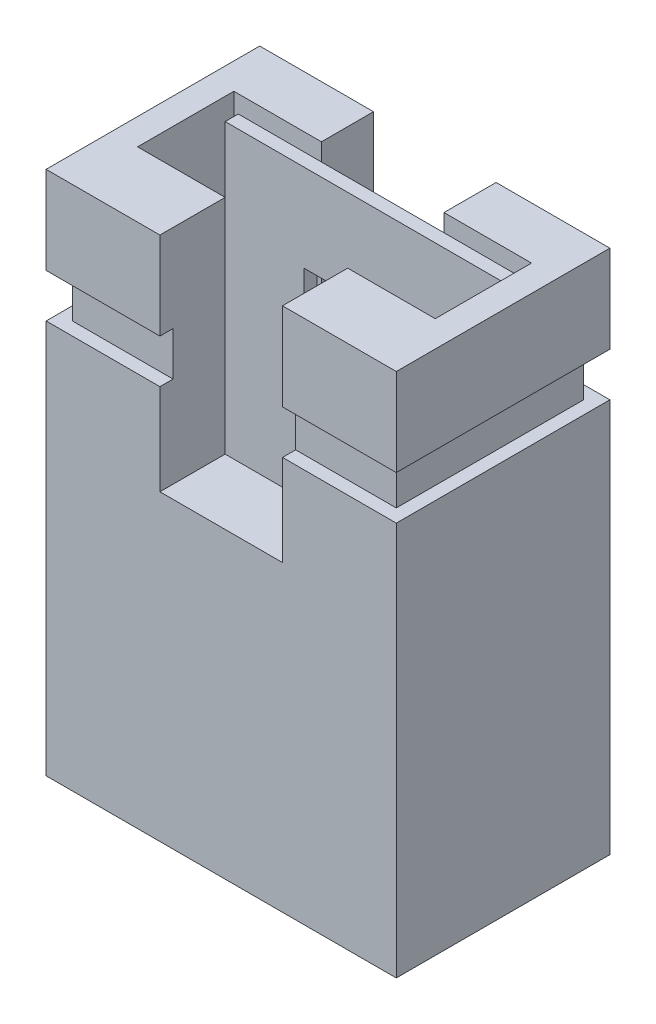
from build123d import *

# Parameters (mm, degrees)
EXTRUDE_1_DEPTH     = 1.22
SKETCH_2_W          = 0.15
SKETCH_2_H          = 0.5
CUT_EXTRUDE_2_DEPTH = 8.232627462
SKETCH_3_W          = 3.4
SKETCH_3_H          = 1.1
CUT_EXTRUDE_3_DEPTH = 7.441148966
SKETCH_4_W          = 3.3
SKETCH_4_H          = 5.4
SKETCH_4_W_2        = 1.5
SKETCH_4_H_2        = 2.9
EXTRUDE_4_DEPTH     = 0.15


with BuildPart() as part:
    # Sketch 1 → Extrude 1 (new, symmetric)
    with BuildSketch(Plane.XY):
        Polygon((-2, 0), (2, 0), (2, 4.5), (1.85, 4.5), (1.85, 5), (2, 5), (2, 6), (0.7, 6), (0.7, 3.46), (-0.7, 3.46), (-0.7, 6), (-2, 6), (-2, 5), (-1.85, 5), (-1.85, 4.5), (-2, 4.5), align=None)
    extrude(amount=EXTRUDE_1_DEPTH, both=True)

    # Sketch 2 → Cut-Extrude 2 (cut, through all)
    with BuildSketch(Plane(origin=(1.85, 0, 0), x_dir=(0, 0, -1), z_dir=(1, 0, 0))):
        with Locations((-1.145, 4.75)):
            Rectangle(SKETCH_2_W, SKETCH_2_H)
        with Locations((1.145, 4.75)):
            Rectangle(SKETCH_2_W, SKETCH_2_H)
    extrude(amount=-CUT_EXTRUDE_2_DEPTH, mode=Mode.SUBTRACT)

    # Sketch 3 → Cut-Extrude 3 (cut, through all)
    with BuildSketch(Plane(origin=(0, 0, 0), x_dir=(1, 0, 0), z_dir=(0, 1, 0))):
        with Locations((0, 0.075)):
            Rectangle(SKETCH_3_W, SKETCH_3_H)
    extrude(amount=CUT_EXTRUDE_3_DEPTH, mode=Mode.SUBTRACT)

    # Sketch 4 → Extrude 4 (add)
    with BuildSketch(Plane.XY.offset(-0.625)):
        with Locations((0, 3.1)):
            Rectangle(SKETCH_4_W, SKETCH_4_H)
        with Locations((0, 3.35)):
            Rectangle(SKETCH_4_W_2, SKETCH_4_H_2, mode=Mode.SUBTRACT)
    extrude(amount=EXTRUDE_4_DEPTH)


solid = part.part
